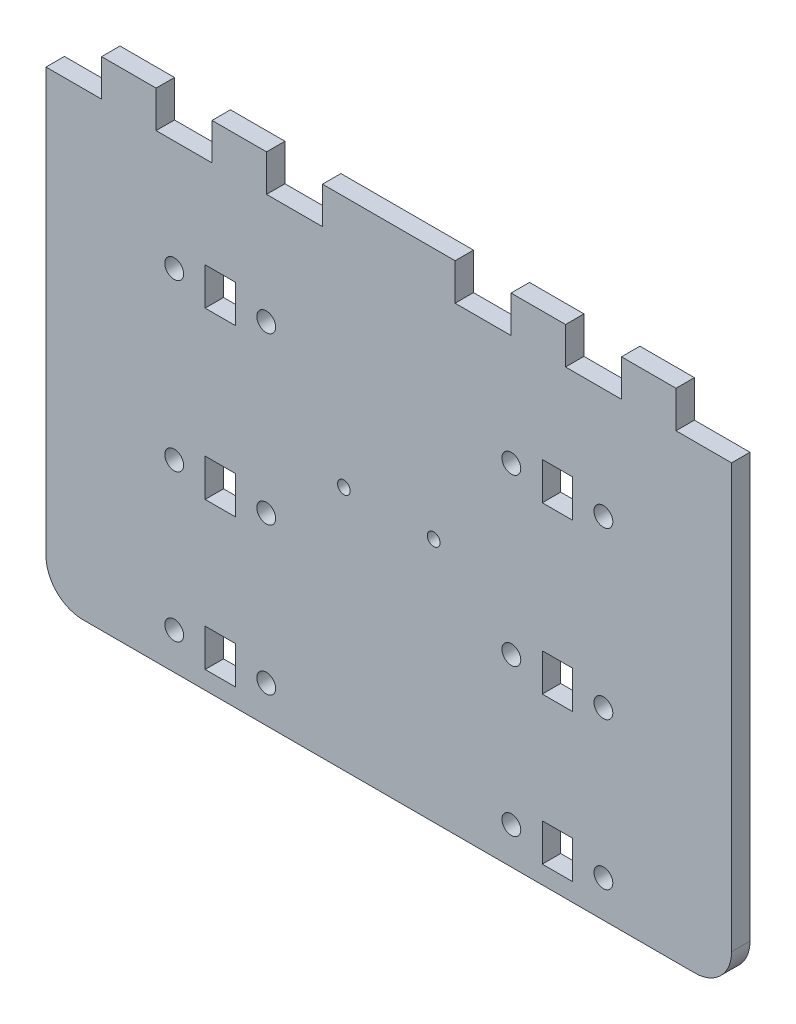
from build123d import *

# Parameters (mm, degrees)
BOSS_EXTRUDE1_DEPTH = 6.35
SKETCH3_W           = 236.5
SKETCH3_H           = 44.45
BOSS_EXTRUDE2_DEPTH = 6.35
FILLET2_R           = 12.7
SKETCH5_W           = 10.414
SKETCH5_H           = 12.954
SKETCH5_R           = 3.25
CUT_EXTRUDE1_DEPTH  = 174.64442116
SKETCH6_R           = 2.2
CUT_EXTRUDE2_DEPTH  = 174.64442116


with BuildPart() as part:
    # Sketch1 → Boss-Extrude1 (new body)
    with BuildSketch(Plane.XY):
        Polygon((-118.25, 114.3), (-99.073, 114.3), (-99.073, 127), (-80.277, 127), (-80.277, 114.3), (-60.973, 114.3), (-60.973, 127), (-42.177, 127), (-42.177, 114.3), (-22.873, 114.3), (-22.873, 127), (22.873, 127), (22.873, 114.3), (42.177, 114.3), (42.177, 127), (60.973, 127), (60.973, 114.3), (80.277, 114.3), (80.277, 127), (99.073, 127), (99.073, 114.3), (118.25, 114.3), (118.25, 0), (-118.25, 0), align=None)
    extrude(amount=-BOSS_EXTRUDE1_DEPTH)

    # Sketch3 → Boss-Extrude2 (add)
    with BuildSketch(Plane.XY):
        with Locations((0, -22.225)):
            Rectangle(SKETCH3_W, SKETCH3_H)
    extrude(amount=-BOSS_EXTRUDE2_DEPTH)

    # Fillet2
    fillet2_edges = [part.edges().sort_by_distance(p)[0] for p in [
        (-118.25, -44.45, -3.175),
        (118.25, -44.45, -3.175),
    ]]
    fillet(fillet2_edges, radius=FILLET2_R)

    # Sketch5 → Cut-Extrude1 (cut, through all)
    with BuildSketch(Plane.XY):
        with Locations((-58.151, 19.05)):
            Rectangle(SKETCH5_W, SKETCH5_H)
        with Locations((-58.151, 76.2)):
            Rectangle(SKETCH5_W, SKETCH5_H)
        with Locations((58.151, 76.2)):
            Rectangle(SKETCH5_W, SKETCH5_H)
        with Locations((58.151, 19.05)):
            Rectangle(SKETCH5_W, SKETCH5_H)
        with Locations((42.276, 19.05)):
            Circle(SKETCH5_R)
        with Locations((74.026, 19.05)):
            Circle(SKETCH5_R)
        with Locations((42.276, 76.2)):
            Circle(SKETCH5_R)
        with Locations((74.026, 76.2)):
            Circle(SKETCH5_R)
        with Locations((-42.276, 76.2)):
            Circle(SKETCH5_R)
        with Locations((-42.276, 19.05)):
            Circle(SKETCH5_R)
        with Locations((-74.026, 76.2)):
            Circle(SKETCH5_R)
        with Locations((-74.026, 19.05)):
            Circle(SKETCH5_R)
        with Locations((-58.151, -31.75)):
            Rectangle(SKETCH5_W, SKETCH5_H)
        with Locations((-74.026, -31.75)):
            Circle(SKETCH5_R)
        with Locations((-42.276, -31.75)):
            Circle(SKETCH5_R)
        with Locations((58.151, -31.75)):
            Rectangle(SKETCH5_W, SKETCH5_H)
        with Locations((74.026, -31.75)):
            Circle(SKETCH5_R)
        with Locations((42.276, -31.75)):
            Circle(SKETCH5_R)
    extrude(amount=-CUT_EXTRUDE1_DEPTH, mode=Mode.SUBTRACT)

    # Sketch6 → Cut-Extrude2 (cut, through all)
    with BuildSketch(Plane.XY):
        with Locations((-15.494, 40.132)):
            Circle(SKETCH6_R)
        with Locations((15.494, 40.132)):
            Circle(SKETCH6_R)
    extrude(amount=-CUT_EXTRUDE2_DEPTH, mode=Mode.SUBTRACT)


solid = part.part
